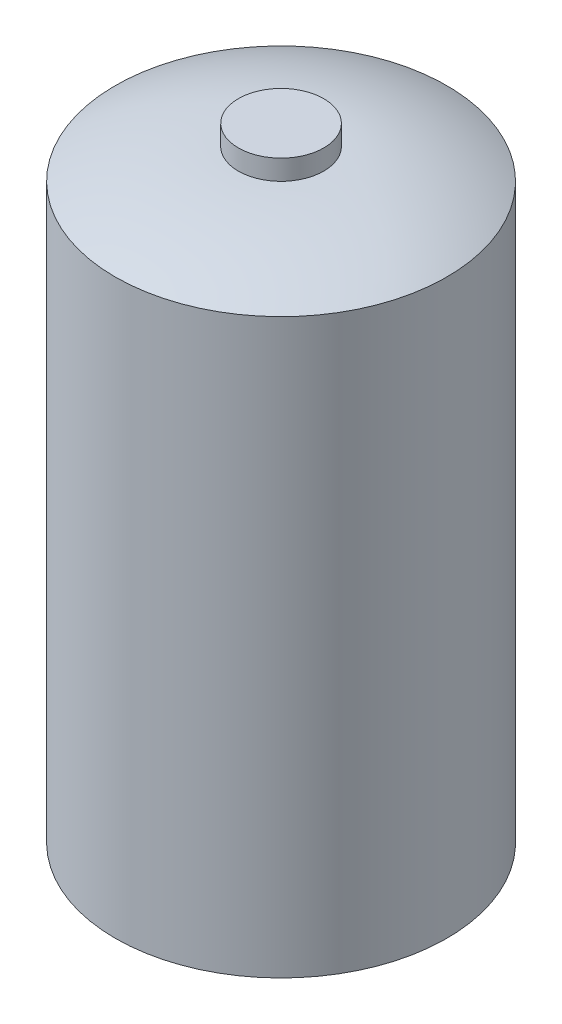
from build123d import *


with BuildPart() as part:
    # Esquisse1 → R_volution1 (revolve)
    with BuildSketch(Plane.XY, mode=Mode.PRIVATE) as r_volution1_sk:
        with BuildLine():
            Line((0, 0), (4.25, 0))
            Line((4.25, 0), (4.25, -2))
            ThreePointArc((4.25, -2), (10.555999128, -2.760920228), (16.5, -5))
            Line((16.5, -5), (16.5, -62))
            Line((16.5, -62), (0, -62))
            Line((0, -62), (0, 0))
        make_face()
    revolve(r_volution1_sk.sketch.rotate(Axis((0, 0, 0), (0, -1, 0)), 90), axis=Axis((0, 0, 0), (0, -1, 0)))


solid = part.part
